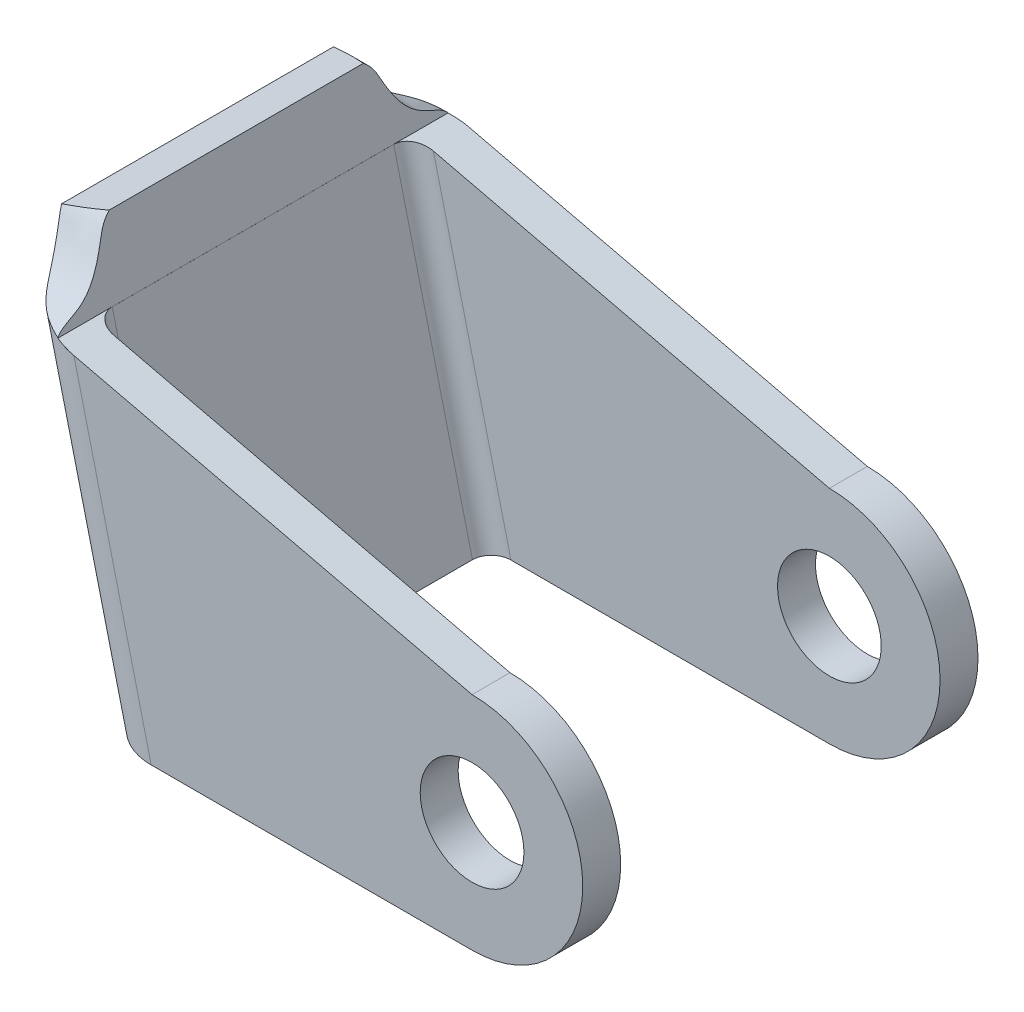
ISO-10303-21;
HEADER;
FILE_DESCRIPTION(('STEP AP214'),'2;1');
FILE_NAME('part.step','',(''),(''),'','','');
FILE_SCHEMA(('AUTOMOTIVE_DESIGN { 1 0 10303 214 1 1 1 1 }'));
ENDSEC;
DATA;
#1=APPLICATION_CONTEXT('core data for automotive mechanical design processes');
#2=APPLICATION_PROTOCOL_DEFINITION('international standard','automotive_design',2000,#1);
#3=PRODUCT_CONTEXT('',#1,'mechanical');
#4=PRODUCT('Part','Part','',(#3));
#5=PRODUCT_RELATED_PRODUCT_CATEGORY('part','',(#4));
#6=PRODUCT_DEFINITION_FORMATION('','',#4);
#7=PRODUCT_DEFINITION_CONTEXT('part definition',#1,'design');
#8=PRODUCT_DEFINITION('design','',#6,#7);
#9=PRODUCT_DEFINITION_SHAPE('','',#8);
#10=(LENGTH_UNIT() NAMED_UNIT(*) SI_UNIT(.MILLI.,.METRE.));
#11=(NAMED_UNIT(*) PLANE_ANGLE_UNIT() SI_UNIT($,.RADIAN.));
#12=(NAMED_UNIT(*) SI_UNIT($,.STERADIAN.) SOLID_ANGLE_UNIT());
#13=UNCERTAINTY_MEASURE_WITH_UNIT(LENGTH_MEASURE(1.E-05),#10,'distance_accuracy_value','');
#14=(GEOMETRIC_REPRESENTATION_CONTEXT(3) GLOBAL_UNCERTAINTY_ASSIGNED_CONTEXT((#13)) GLOBAL_UNIT_ASSIGNED_CONTEXT((#10,
#11,#12)) REPRESENTATION_CONTEXT('',''));
#15=CARTESIAN_POINT('',(0.,0.,0.));
#16=DIRECTION('',(0.,0.,1.));
#17=DIRECTION('',(1.,0.,0.));
#18=AXIS2_PLACEMENT_3D('',#15,#16,#17);
#19=CARTESIAN_POINT('',(0.,0.,7.9375));
#20=DIRECTION('',(0.,0.,-1.));
#21=DIRECTION('',(-1.,0.,0.));
#22=AXIS2_PLACEMENT_3D('',#19,#20,#21);
#23=CYLINDRICAL_SURFACE('',#22,4.445);
#24=CARTESIAN_POINT('',(0.,0.,6.4135));
#25=DIRECTION('',(0.,0.,-1.));
#26=DIRECTION('',(-1.,0.,0.));
#27=AXIS2_PLACEMENT_3D('',#24,#25,#26);
#28=CIRCLE('',#27,4.445);
#29=CARTESIAN_POINT('',(0.,4.445,6.4135));
#30=VERTEX_POINT('',#29);
#31=CARTESIAN_POINT('',(0.,-4.445,6.4135));
#32=VERTEX_POINT('',#31);
#33=EDGE_CURVE('E369',#30,#32,#28,.T.);
#34=ORIENTED_EDGE('',*,*,#33,.F.);
#35=DIRECTION('',(0.,0.,-1.));
#36=VECTOR('',#35,1.);
#37=CARTESIAN_POINT('',(0.,4.445,7.9375));
#38=LINE('',#37,#36);
#39=CARTESIAN_POINT('',(0.,4.445,7.9375));
#40=VERTEX_POINT('',#39);
#41=EDGE_CURVE('E193',#40,#30,#38,.T.);
#42=ORIENTED_EDGE('',*,*,#41,.F.);
#43=CARTESIAN_POINT('',(0.,0.,7.9375));
#44=DIRECTION('',(0.,0.,1.));
#45=DIRECTION('',(1.,0.,0.));
#46=AXIS2_PLACEMENT_3D('',#43,#44,#45);
#47=CIRCLE('',#46,4.445);
#48=CARTESIAN_POINT('',(0.,-4.445,7.9375));
#49=VERTEX_POINT('',#48);
#50=EDGE_CURVE('E363',#49,#40,#47,.T.);
#51=ORIENTED_EDGE('',*,*,#50,.F.);
#52=DIRECTION('',(0.,0.,-1.));
#53=VECTOR('',#52,1.);
#54=CARTESIAN_POINT('',(0.,-4.445,7.9375));
#55=LINE('',#54,#53);
#56=EDGE_CURVE('E186',#49,#32,#55,.T.);
#57=ORIENTED_EDGE('',*,*,#56,.T.);
#58=EDGE_LOOP('',(#34,#42,#51,#57));
#59=FACE_BOUND('',#58,.T.);
#60=ADVANCED_FACE('F30',(#59),#23,.T.);
#61=CARTESIAN_POINT('',(0.,4.445,7.9375));
#62=DIRECTION('',(-0.231189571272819,-0.972908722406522,0.));
#63=DIRECTION('',(0.972908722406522,-0.231189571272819,0.));
#64=AXIS2_PLACEMENT_3D('',#61,#62,#63);
#65=PLANE('',#64);
#66=CARTESIAN_POINT('',(-15.9881489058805,8.24421898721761,-5.6515));
#67=DIRECTION('',(-0.231189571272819,-0.972908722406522,0.));
#68=DIRECTION('',(0.972908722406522,-0.231189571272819,0.));
#69=AXIS2_PLACEMENT_3D('',#66,#67,#68);
#70=ELLIPSE('',#69,2.5679668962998,2.286);
#71=CARTESIAN_POINT('',(-15.9881489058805,8.24421898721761,-7.9375));
#72=VERTEX_POINT('',#71);
#73=CARTESIAN_POINT('',(-16.2225683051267,8.29992341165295,-7.92741515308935));
#74=VERTEX_POINT('',#73);
#75=EDGE_CURVE('E244',#72,#74,#70,.F.);
#76=ORIENTED_EDGE('',*,*,#75,.T.);
#77=CARTESIAN_POINT('',(-16.1339768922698,8.2788716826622,-7.9375));
#78=CARTESIAN_POINT('',(-16.1677330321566,8.28689305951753,-7.93385605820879));
#79=CARTESIAN_POINT('',(-16.2014674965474,8.29490928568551,-7.92999399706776));
#80=CARTESIAN_POINT('',(-16.2688651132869,8.31092479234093,-7.9217951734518));
#81=CARTESIAN_POINT('',(-16.3025282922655,8.31892407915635,-7.91745864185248));
#82=CARTESIAN_POINT('',(-16.3697787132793,8.33490460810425,-7.9082702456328));
#83=CARTESIAN_POINT('',(-16.4033659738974,8.34288585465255,-7.90341852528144));
#84=CARTESIAN_POINT('',(-16.4704626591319,8.35882985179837,-7.89316456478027));
#85=CARTESIAN_POINT('',(-16.5039720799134,8.36679260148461,-7.88776229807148));
#86=CARTESIAN_POINT('',(-16.5709041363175,8.38269747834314,-7.87636773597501));
#87=CARTESIAN_POINT('',(-16.6043267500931,8.39063960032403,-7.87037530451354));
#88=CARTESIAN_POINT('',(-16.6710774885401,8.4065013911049,-7.85775785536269));
#89=CARTESIAN_POINT('',(-16.7044055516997,8.41442104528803,-7.85113249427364));
#90=CARTESIAN_POINT('',(-16.7376681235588,8.42232513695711,-7.84417210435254));
#91=B_SPLINE_CURVE_WITH_KNOTS('',3,(#77,#78,#79,#80,#81,#82,#83,#84,#85,#86,#87,#88,#89,#90),
.UNSPECIFIED.,.F.,.F.,(4,2,2,2,2,2,4),(0.,0.104661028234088,0.209271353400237,0.313852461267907,
0.418438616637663,0.523048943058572,0.627716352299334),.UNSPECIFIED.);
#92=CARTESIAN_POINT('',(-16.5229555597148,8.37130359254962,-7.88451175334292));
#93=VERTEX_POINT('',#92);
#94=EDGE_CURVE('E332',#74,#93,#91,.T.);
#95=ORIENTED_EDGE('',*,*,#94,.T.);
#96=CARTESIAN_POINT('',(-16.7376681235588,8.42232513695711,-7.83220501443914));
#97=VERTEX_POINT('',#96);
#98=EDGE_CURVE('E243',#93,#97,#70,.F.);
#99=ORIENTED_EDGE('',*,*,#98,.T.);
#100=DIRECTION('',(0.,0.,-1.));
#101=VECTOR('',#100,1.);
#102=CARTESIAN_POINT('',(-16.7376681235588,8.42232513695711,7.9375));
#103=LINE('',#102,#101);
#104=CARTESIAN_POINT('',(-16.7376681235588,8.42232513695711,7.83220501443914));
#105=VERTEX_POINT('',#104);
#106=EDGE_CURVE('E183',#105,#97,#103,.T.);
#107=ORIENTED_EDGE('',*,*,#106,.F.);
#108=CARTESIAN_POINT('',(-15.9881489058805,8.24421898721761,5.6515));
#109=DIRECTION('',(-0.231189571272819,-0.972908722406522,0.));
#110=DIRECTION('',(-0.972908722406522,0.231189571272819,0.));
#111=AXIS2_PLACEMENT_3D('',#108,#109,#110);
#112=ELLIPSE('',#111,2.5679668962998,2.286);
#113=CARTESIAN_POINT('',(-16.5229555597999,8.37130359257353,7.88451175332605));
#114=VERTEX_POINT('',#113);
#115=EDGE_CURVE('E248',#105,#114,#112,.F.);
#116=ORIENTED_EDGE('',*,*,#115,.T.);
#117=CARTESIAN_POINT('',(-16.7376681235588,8.42232513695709,7.84417210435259));
#118=CARTESIAN_POINT('',(-16.7044055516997,8.41442104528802,7.85113249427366));
#119=CARTESIAN_POINT('',(-16.6710774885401,8.4065013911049,7.85775785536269));
#120=CARTESIAN_POINT('',(-16.6043267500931,8.39063960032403,7.87037530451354));
#121=CARTESIAN_POINT('',(-16.5709041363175,8.38269747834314,7.87636773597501));
#122=CARTESIAN_POINT('',(-16.5039720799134,8.36679260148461,7.88776229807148));
#123=CARTESIAN_POINT('',(-16.4704626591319,8.35882985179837,7.89316456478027));
#124=CARTESIAN_POINT('',(-16.4033659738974,8.34288585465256,7.90341852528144));
#125=CARTESIAN_POINT('',(-16.3697787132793,8.33490460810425,7.9082702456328));
#126=CARTESIAN_POINT('',(-16.3025282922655,8.31892407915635,7.91745864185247));
#127=CARTESIAN_POINT('',(-16.2688651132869,8.31092479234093,7.9217951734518));
#128=CARTESIAN_POINT('',(-16.2014674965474,8.29490928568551,7.92999399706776));
#129=CARTESIAN_POINT('',(-16.1677330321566,8.28689305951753,7.93385605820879));
#130=CARTESIAN_POINT('',(-16.1339768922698,8.2788716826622,7.9375));
#131=B_SPLINE_CURVE_WITH_KNOTS('',3,(#117,#118,#119,#120,#121,#122,#123,#124,#125,#126,#127,
#128,#129,#130),.UNSPECIFIED.,.F.,.F.,(4,2,2,2,2,2,4),(0.,0.104667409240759,0.209277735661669,
0.313863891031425,0.418444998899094,0.52305532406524,0.627716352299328),.UNSPECIFIED.);
#132=CARTESIAN_POINT('',(-16.2225683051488,8.2999234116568,7.92741515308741));
#133=VERTEX_POINT('',#132);
#134=EDGE_CURVE('E49',#114,#133,#131,.T.);
#135=ORIENTED_EDGE('',*,*,#134,.T.);
#136=CARTESIAN_POINT('',(-15.9881489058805,8.24421898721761,7.9375));
#137=VERTEX_POINT('',#136);
#138=EDGE_CURVE('E247',#133,#137,#112,.F.);
#139=ORIENTED_EDGE('',*,*,#138,.T.);
#140=DIRECTION('',(-0.972908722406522,0.231189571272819,0.));
#141=VECTOR('',#140,1.);
#142=CARTESIAN_POINT('',(0.,4.445,7.9375));
#143=LINE('',#142,#141);
#144=EDGE_CURVE('E354',#40,#137,#143,.T.);
#145=ORIENTED_EDGE('',*,*,#144,.F.);
#146=ORIENTED_EDGE('',*,*,#41,.T.);
#147=DIRECTION('',(0.972908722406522,-0.231189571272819,0.));
#148=VECTOR('',#147,1.);
#149=CARTESIAN_POINT('',(0.,4.445,6.4135));
#150=LINE('',#149,#148);
#151=CARTESIAN_POINT('',(-15.9033399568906,8.22406607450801,6.4135));
#152=VERTEX_POINT('',#151);
#153=EDGE_CURVE('E388',#152,#30,#150,.T.);
#154=ORIENTED_EDGE('',*,*,#153,.F.);
#155=CARTESIAN_POINT('',(-15.9033399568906,8.22406607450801,5.6515));
#156=DIRECTION('',(-0.231189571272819,-0.972908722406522,0.));
#157=DIRECTION('',(-0.972908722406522,0.231189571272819,0.));
#158=AXIS2_PLACEMENT_3D('',#155,#156,#157);
#159=ELLIPSE('',#158,0.856606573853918,0.762);
#160=CARTESIAN_POINT('',(-16.7367399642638,8.42210458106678,5.6515));
#161=VERTEX_POINT('',#160);
#162=EDGE_CURVE('E225',#152,#161,#159,.T.);
#163=ORIENTED_EDGE('',*,*,#162,.T.);
#164=DIRECTION('',(0.,0.,1.));
#165=VECTOR('',#164,1.);
#166=CARTESIAN_POINT('',(-16.7367399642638,8.42210458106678,7.9375));
#167=LINE('',#166,#165);
#168=CARTESIAN_POINT('',(-16.7367399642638,8.42210458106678,-5.6515));
#169=VERTEX_POINT('',#168);
#170=EDGE_CURVE('E385',#169,#161,#167,.T.);
#171=ORIENTED_EDGE('',*,*,#170,.F.);
#172=CARTESIAN_POINT('',(-15.9033399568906,8.22406607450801,-5.6515));
#173=DIRECTION('',(-0.231189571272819,-0.972908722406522,0.));
#174=DIRECTION('',(0.972908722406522,-0.231189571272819,0.));
#175=AXIS2_PLACEMENT_3D('',#172,#173,#174);
#176=ELLIPSE('',#175,0.856606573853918,0.762);
#177=CARTESIAN_POINT('',(-15.9033399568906,8.22406607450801,-6.4135));
#178=VERTEX_POINT('',#177);
#179=EDGE_CURVE('E221',#169,#178,#176,.T.);
#180=ORIENTED_EDGE('',*,*,#179,.T.);
#181=DIRECTION('',(0.972908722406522,-0.231189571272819,0.));
#182=VECTOR('',#181,1.);
#183=CARTESIAN_POINT('',(0.,4.445,-6.4135));
#184=LINE('',#183,#182);
#185=CARTESIAN_POINT('',(0.,4.445,-6.4135));
#186=VERTEX_POINT('',#185);
#187=EDGE_CURVE('E206',#178,#186,#184,.T.);
#188=ORIENTED_EDGE('',*,*,#187,.T.);
#189=CARTESIAN_POINT('',(0.,4.445,-7.9375));
#190=VERTEX_POINT('',#189);
#191=EDGE_CURVE('E192',#186,#190,#38,.T.);
#192=ORIENTED_EDGE('',*,*,#191,.T.);
#193=DIRECTION('',(-0.972908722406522,0.231189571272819,0.));
#194=VECTOR('',#193,1.);
#195=CARTESIAN_POINT('',(0.,4.445,-7.9375));
#196=LINE('',#195,#194);
#197=EDGE_CURVE('E376',#190,#72,#196,.T.);
#198=ORIENTED_EDGE('',*,*,#197,.T.);
#199=EDGE_LOOP('',(#76,#95,#99,#107,#116,#135,#139,#145,#146,#154,#163,#171,#180,#188,#192,#198));
#200=FACE_BOUND('',#199,.T.);
#201=ADVANCED_FACE('F326',(#200),#65,.F.);
#202=CARTESIAN_POINT('',(0.,-4.445,7.9375));
#203=DIRECTION('',(0.,1.,0.));
#204=DIRECTION('',(-1.,0.,0.));
#205=AXIS2_PLACEMENT_3D('',#202,#203,#204);
#206=PLANE('',#205);
#207=DIRECTION('',(1.,0.,0.));
#208=VECTOR('',#207,1.);
#209=CARTESIAN_POINT('',(0.,-4.445,7.9375));
#210=LINE('',#209,#208);
#211=CARTESIAN_POINT('',(-12.8867088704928,-4.445,7.9375));
#212=VERTEX_POINT('',#211);
#213=EDGE_CURVE('E352',#212,#49,#210,.T.);
#214=ORIENTED_EDGE('',*,*,#213,.F.);
#215=CARTESIAN_POINT('',(-12.8867088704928,-4.445,5.6515));
#216=DIRECTION('',(0.,1.,0.));
#217=DIRECTION('',(-1.,0.,0.));
#218=AXIS2_PLACEMENT_3D('',#215,#216,#217);
#219=ELLIPSE('',#218,2.35329112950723,2.286);
#220=CARTESIAN_POINT('',(-15.24,-4.445,5.6515));
#221=VERTEX_POINT('',#220);
#222=EDGE_CURVE('E232',#212,#221,#219,.F.);
#223=ORIENTED_EDGE('',*,*,#222,.T.);
#224=DIRECTION('',(0.,0.,-1.));
#225=VECTOR('',#224,1.);
#226=CARTESIAN_POINT('',(-15.24,-4.445,7.9375));
#227=LINE('',#226,#225);
#228=CARTESIAN_POINT('',(-15.24,-4.445,-5.6515));
#229=VERTEX_POINT('',#228);
#230=EDGE_CURVE('E181',#221,#229,#227,.T.);
#231=ORIENTED_EDGE('',*,*,#230,.T.);
#232=CARTESIAN_POINT('',(-12.8867088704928,-4.445,-5.6515));
#233=DIRECTION('',(0.,1.,0.));
#234=DIRECTION('',(1.,0.,0.));
#235=AXIS2_PLACEMENT_3D('',#232,#233,#234);
#236=ELLIPSE('',#235,2.35329112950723,2.286);
#237=CARTESIAN_POINT('',(-12.8867088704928,-4.445,-7.9375));
#238=VERTEX_POINT('',#237);
#239=EDGE_CURVE('E230',#229,#238,#236,.F.);
#240=ORIENTED_EDGE('',*,*,#239,.T.);
#241=DIRECTION('',(1.,0.,0.));
#242=VECTOR('',#241,1.);
#243=CARTESIAN_POINT('',(0.,-4.445,-7.9375));
#244=LINE('',#243,#242);
#245=CARTESIAN_POINT('',(0.,-4.445,-7.9375));
#246=VERTEX_POINT('',#245);
#247=EDGE_CURVE('E372',#238,#246,#244,.T.);
#248=ORIENTED_EDGE('',*,*,#247,.T.);
#249=CARTESIAN_POINT('',(0.,-4.445,-6.4135));
#250=VERTEX_POINT('',#249);
#251=EDGE_CURVE('E360',#250,#246,#55,.T.);
#252=ORIENTED_EDGE('',*,*,#251,.F.);
#253=DIRECTION('',(-1.,0.,0.));
#254=VECTOR('',#253,1.);
#255=CARTESIAN_POINT('',(0.,-4.445,-6.4135));
#256=LINE('',#255,#254);
#257=CARTESIAN_POINT('',(-12.7879301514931,-4.445,-6.4135));
#258=VERTEX_POINT('',#257);
#259=EDGE_CURVE('E200',#250,#258,#256,.T.);
#260=ORIENTED_EDGE('',*,*,#259,.T.);
#261=CARTESIAN_POINT('',(-12.7879301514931,-4.445,-5.6515));
#262=DIRECTION('',(0.,1.,0.));
#263=DIRECTION('',(1.,0.,0.));
#264=AXIS2_PLACEMENT_3D('',#261,#262,#263);
#265=ELLIPSE('',#264,0.78470098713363,0.762);
#266=CARTESIAN_POINT('',(-13.5726311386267,-4.445,-5.6515));
#267=VERTEX_POINT('',#266);
#268=EDGE_CURVE('E219',#258,#267,#265,.T.);
#269=ORIENTED_EDGE('',*,*,#268,.T.);
#270=DIRECTION('',(0.,0.,-1.));
#271=VECTOR('',#270,1.);
#272=CARTESIAN_POINT('',(-13.5726311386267,-4.445,7.9375));
#273=LINE('',#272,#271);
#274=CARTESIAN_POINT('',(-13.5726311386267,-4.445,5.6515));
#275=VERTEX_POINT('',#274);
#276=EDGE_CURVE('E196',#275,#267,#273,.T.);
#277=ORIENTED_EDGE('',*,*,#276,.F.);
#278=CARTESIAN_POINT('',(-12.7879301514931,-4.445,5.6515));
#279=DIRECTION('',(0.,1.,0.));
#280=DIRECTION('',(-1.,0.,0.));
#281=AXIS2_PLACEMENT_3D('',#278,#279,#280);
#282=ELLIPSE('',#281,0.78470098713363,0.762);
#283=CARTESIAN_POINT('',(-12.7879301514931,-4.445,6.4135));
#284=VERTEX_POINT('',#283);
#285=EDGE_CURVE('E223',#275,#284,#282,.T.);
#286=ORIENTED_EDGE('',*,*,#285,.T.);
#287=DIRECTION('',(-1.,0.,0.));
#288=VECTOR('',#287,1.);
#289=CARTESIAN_POINT('',(0.,-4.445,6.4135));
#290=LINE('',#289,#288);
#291=EDGE_CURVE('E205',#32,#284,#290,.T.);
#292=ORIENTED_EDGE('',*,*,#291,.F.);
#293=ORIENTED_EDGE('',*,*,#56,.F.);
#294=EDGE_LOOP('',(#214,#223,#231,#240,#248,#252,#260,#269,#277,#286,#292,#293));
#295=FACE_BOUND('',#294,.T.);
#296=ADVANCED_FACE('F296',(#295),#206,.F.);
#297=CARTESIAN_POINT('',(0.,0.,7.9375));
#298=DIRECTION('',(0.,0.,-1.));
#299=DIRECTION('',(-1.,0.,0.));
#300=AXIS2_PLACEMENT_3D('',#297,#298,#299);
#301=CYLINDRICAL_SURFACE('',#300,2.0828);
#302=CARTESIAN_POINT('',(0.,0.,7.9375));
#303=DIRECTION('',(0.,0.,1.));
#304=DIRECTION('',(1.,0.,0.));
#305=AXIS2_PLACEMENT_3D('',#302,#303,#304);
#306=CIRCLE('',#305,2.0828);
#307=CARTESIAN_POINT('',(2.0828,0.,7.9375));
#308=VERTEX_POINT('',#307);
#309=EDGE_CURVE('E370',#308,#308,#306,.T.);
#310=ORIENTED_EDGE('',*,*,#309,.T.);
#311=EDGE_LOOP('',(#310));
#312=FACE_BOUND('',#311,.T.);
#313=CARTESIAN_POINT('',(0.,0.,6.4135));
#314=DIRECTION('',(0.,0.,-1.));
#315=DIRECTION('',(-1.,0.,0.));
#316=AXIS2_PLACEMENT_3D('',#313,#314,#315);
#317=CIRCLE('',#316,2.0828);
#318=CARTESIAN_POINT('',(-2.0828,0.,6.4135));
#319=VERTEX_POINT('',#318);
#320=EDGE_CURVE('E202',#319,#319,#317,.T.);
#321=ORIENTED_EDGE('',*,*,#320,.T.);
#322=EDGE_LOOP('',(#321));
#323=FACE_BOUND('',#322,.T.);
#324=ADVANCED_FACE('F440',(#312,#323),#301,.F.);
#325=CARTESIAN_POINT('',(0.,0.,7.9375));
#326=DIRECTION('',(0.,0.,1.));
#327=DIRECTION('',(1.,0.,0.));
#328=AXIS2_PLACEMENT_3D('',#325,#326,#327);
#329=PLANE('',#328);
#330=ORIENTED_EDGE('',*,*,#144,.T.);
#331=DIRECTION('',(0.237426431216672,-0.971405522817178,0.));
#332=VECTOR('',#331,1.);
#333=CARTESIAN_POINT('',(-13.0193669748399,-3.90224317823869,7.9375));
#334=LINE('',#333,#332);
#335=EDGE_CURVE('E227',#137,#212,#334,.T.);
#336=ORIENTED_EDGE('',*,*,#335,.T.);
#337=ORIENTED_EDGE('',*,*,#213,.T.);
#338=ORIENTED_EDGE('',*,*,#50,.T.);
#339=EDGE_LOOP('',(#330,#336,#337,#338));
#340=FACE_BOUND('',#339,.T.);
#341=ORIENTED_EDGE('',*,*,#309,.F.);
#342=EDGE_LOOP('',(#341));
#343=FACE_BOUND('',#342,.T.);
#344=ADVANCED_FACE('F349',(#340,#343),#329,.T.);
#345=ORIENTED_EDGE('',*,*,#191,.F.);
#346=CARTESIAN_POINT('',(0.,0.,-6.4135));
#347=DIRECTION('',(0.,0.,-1.));
#348=DIRECTION('',(-1.,0.,0.));
#349=AXIS2_PLACEMENT_3D('',#346,#347,#348);
#350=CIRCLE('',#349,4.445);
#351=EDGE_CURVE('E393',#186,#250,#350,.T.);
#352=ORIENTED_EDGE('',*,*,#351,.T.);
#353=ORIENTED_EDGE('',*,*,#251,.T.);
#354=CARTESIAN_POINT('',(0.,0.,-7.9375));
#355=DIRECTION('',(0.,0.,1.));
#356=DIRECTION('',(1.,0.,0.));
#357=AXIS2_PLACEMENT_3D('',#354,#355,#356);
#358=CIRCLE('',#357,4.445);
#359=EDGE_CURVE('E379',#246,#190,#358,.T.);
#360=ORIENTED_EDGE('',*,*,#359,.T.);
#361=EDGE_LOOP('',(#345,#352,#353,#360));
#362=FACE_BOUND('',#361,.T.);
#363=ADVANCED_FACE('F32',(#362),#23,.T.);
#364=CARTESIAN_POINT('',(-16.7376681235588,8.42232513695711,7.9375));
#365=DIRECTION('',(-0.971405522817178,-0.237426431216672,0.));
#366=DIRECTION('',(0.237426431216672,-0.971405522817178,0.));
#367=AXIS2_PLACEMENT_3D('',#364,#365,#366);
#368=PLANE('',#367);
#369=DIRECTION('',(0.237426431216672,-0.971405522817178,0.));
#370=VECTOR('',#369,1.);
#371=CARTESIAN_POINT('',(-16.7376681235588,8.42232513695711,-7.83220501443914));
#372=LINE('',#371,#370);
#373=CARTESIAN_POINT('',(-16.7408977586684,8.43553885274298,-7.83220501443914));
#374=VERTEX_POINT('',#373);
#375=EDGE_CURVE('E238',#97,#374,#372,.F.);
#376=ORIENTED_EDGE('',*,*,#375,.T.);
#377=CARTESIAN_POINT('',(-16.7408977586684,8.43553885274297,-7.83220501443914));
#378=CARTESIAN_POINT('',(-16.7450739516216,8.45262531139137,-7.81630435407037));
#379=CARTESIAN_POINT('',(-16.7490404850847,8.46885397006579,-7.79948220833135));
#380=CARTESIAN_POINT('',(-16.7565587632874,8.49961422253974,-7.76450328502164));
#381=CARTESIAN_POINT('',(-16.7601135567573,8.51415828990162,-7.74635818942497));
#382=CARTESIAN_POINT('',(-16.766872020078,8.54180983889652,-7.70901118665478));
#383=CARTESIAN_POINT('',(-16.7700763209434,8.55491990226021,-7.68981127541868));
#384=CARTESIAN_POINT('',(-16.7761953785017,8.57995538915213,-7.65057133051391));
#385=CARTESIAN_POINT('',(-16.7791096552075,8.59187884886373,-7.63052997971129));
#386=CARTESIAN_POINT('',(-16.7846980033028,8.61474299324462,-7.5898174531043));
#387=CARTESIAN_POINT('',(-16.7873716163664,8.62568180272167,-7.56914517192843));
#388=CARTESIAN_POINT('',(-16.7925227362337,8.64675707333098,-7.52735691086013));
#389=CARTESIAN_POINT('',(-16.795000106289,8.65689297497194,-7.50624063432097));
#390=CARTESIAN_POINT('',(-16.8022498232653,8.68655443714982,-7.44203512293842));
#391=CARTESIAN_POINT('',(-16.8067883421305,8.70512331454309,-7.39848180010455));
#392=CARTESIAN_POINT('',(-16.8155689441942,8.74104823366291,-7.31089730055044));
#393=CARTESIAN_POINT('',(-16.8198111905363,8.75840494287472,-7.26686640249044));
#394=CARTESIAN_POINT('',(-16.8282841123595,8.79307102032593,-7.1787900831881));
#395=CARTESIAN_POINT('',(-16.8325147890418,8.81038039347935,-7.13474466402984));
#396=CARTESIAN_POINT('',(-16.8412359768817,8.84606222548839,-7.04708612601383));
#397=CARTESIAN_POINT('',(-16.8457265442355,8.86443491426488,-7.00347310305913));
#398=CARTESIAN_POINT('',(-16.8528288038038,8.89349306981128,-6.93914960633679));
#399=CARTESIAN_POINT('',(-16.8552378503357,8.90334943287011,-6.91804571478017));
#400=CARTESIAN_POINT('',(-16.8602253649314,8.92375532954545,-6.87619714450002));
#401=CARTESIAN_POINT('',(-16.8628038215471,8.93430481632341,-6.85545244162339));
#402=CARTESIAN_POINT('',(-16.870819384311,8.96709965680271,-6.79385291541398));
#403=CARTESIAN_POINT('',(-16.8765363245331,8.9904899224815,-6.75363601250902));
#404=CARTESIAN_POINT('',(-16.8886586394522,9.0400871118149,-6.67510597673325));
#405=CARTESIAN_POINT('',(-16.8950638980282,9.06629356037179,-6.63679252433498));
#406=CARTESIAN_POINT('',(-16.9085032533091,9.1212792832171,-6.56222217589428));
#407=CARTESIAN_POINT('',(-16.9155369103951,9.15005675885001,-6.52596387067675));
#408=CARTESIAN_POINT('',(-16.9327585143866,9.2205171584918,-6.44307272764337));
#409=CARTESIAN_POINT('',(-16.9431821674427,9.26316444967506,-6.39730671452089));
#410=CARTESIAN_POINT('',(-16.9649020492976,9.35202908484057,-6.30950821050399));
#411=CARTESIAN_POINT('',(-16.9761994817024,9.39825135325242,-6.26748104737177));
#412=CARTESIAN_POINT('',(-16.999499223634,9.49357982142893,-6.18695599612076));
#413=CARTESIAN_POINT('',(-17.0115023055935,9.54268918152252,-6.14846209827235));
#414=CARTESIAN_POINT('',(-17.0364425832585,9.64472973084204,-6.07354841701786));
#415=CARTESIAN_POINT('',(-17.049397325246,9.6977327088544,-6.03723297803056));
#416=CARTESIAN_POINT('',(-17.075736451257,9.80549650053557,-5.96765206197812));
#417=CARTESIAN_POINT('',(-17.0891203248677,9.86025522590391,-5.93438313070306));
#418=CARTESIAN_POINT('',(-17.1161989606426,9.97104464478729,-5.87043632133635));
#419=CARTESIAN_POINT('',(-17.12989312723,10.0270729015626,-5.8397539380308));
#420=CARTESIAN_POINT('',(-17.1559943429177,10.1338633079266,-5.78374655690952));
#421=CARTESIAN_POINT('',(-17.168375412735,10.1845191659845,-5.75820502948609));
#422=CARTESIAN_POINT('',(-17.1932958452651,10.2864785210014,-5.70837846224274));
#423=CARTESIAN_POINT('',(-17.2058353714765,10.3377826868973,-5.68409487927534));
#424=CARTESIAN_POINT('',(-17.2247527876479,10.4151813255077,-5.6483964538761));
#425=CARTESIAN_POINT('',(-17.2310897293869,10.4411082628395,-5.63659467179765));
#426=CARTESIAN_POINT('',(-17.243763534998,10.4929618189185,-5.61299479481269));
#427=CARTESIAN_POINT('',(-17.2501003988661,10.5188884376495,-5.60119669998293));
#428=CARTESIAN_POINT('',(-17.2687138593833,10.5950434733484,-5.56593740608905));
#429=CARTESIAN_POINT('',(-17.280942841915,10.6450770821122,-5.54199353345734));
#430=CARTESIAN_POINT('',(-17.2989165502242,10.7186146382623,-5.50327071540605));
#431=CARTESIAN_POINT('',(-17.3048333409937,10.7428225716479,-5.48992821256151));
#432=CARTESIAN_POINT('',(-17.3164996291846,10.7905539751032,-5.46200132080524));
#433=CARTESIAN_POINT('',(-17.3222491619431,10.8140775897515,-5.44741719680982));
#434=CARTESIAN_POINT('',(-17.333486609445,10.8600544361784,-5.41675577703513));
#435=CARTESIAN_POINT('',(-17.3389755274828,10.8825117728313,-5.40068505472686));
#436=CARTESIAN_POINT('',(-17.3496779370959,10.9262995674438,-5.36699585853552));
#437=CARTESIAN_POINT('',(-17.3548914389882,10.9476300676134,-5.34937744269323));
#438=CARTESIAN_POINT('',(-17.364563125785,10.9872007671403,-5.31454260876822));
#439=CARTESIAN_POINT('',(-17.3690460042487,11.0055419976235,-5.29744712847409));
#440=CARTESIAN_POINT('',(-17.377798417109,11.0413515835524,-5.26223251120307));
#441=CARTESIAN_POINT('',(-17.3820674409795,11.0588178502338,-5.24411112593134));
#442=CARTESIAN_POINT('',(-17.3904977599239,11.0933096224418,-5.20649231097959));
#443=CARTESIAN_POINT('',(-17.3946530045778,11.1103103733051,-5.1869709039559));
#444=CARTESIAN_POINT('',(-17.402723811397,11.1433312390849,-5.14717813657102));
#445=CARTESIAN_POINT('',(-17.4066401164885,11.1593543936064,-5.12690945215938));
#446=CARTESIAN_POINT('',(-17.4104469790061,11.174929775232,-5.10628811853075));
#447=B_SPLINE_CURVE_WITH_KNOTS('',3,(#377,#378,#379,#380,#381,#382,#383,#384,#385,#386,#387,
#388,#389,#390,#391,#392,#393,#394,#395,#396,#397,#398,#399,#400,#401,#402,#403,#404,#405,#406,
#407,#408,#409,#410,#411,#412,#413,#414,#415,#416,#417,#418,#419,#420,#421,#422,#423,#424,#425,
#426,#427,#428,#429,#430,#431,#432,#433,#434,#435,#436,#437,#438,#439,#440,#441,#442,#443,#444,
#445,#446),.UNSPECIFIED.,.F.,.F.,(4,2,2,2,2,2,2,2,2,2,2,2,2,2,2,2,2,2,2,2,2,2,2,2,2,2,2,2,2,2,2,
2,2,2,4),(0.,0.0710458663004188,0.141526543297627,0.211878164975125,0.282344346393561,
0.352942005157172,0.42358843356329,0.566223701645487,0.708779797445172,0.851320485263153,
0.993892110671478,1.06412986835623,1.13436288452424,1.27483988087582,1.41529321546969,
1.55564904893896,1.74565102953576,1.93591956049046,2.12640039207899,2.32291578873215,
2.51920553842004,2.71514600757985,2.88932328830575,3.06369797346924,3.15124535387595,
3.23879444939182,3.40910185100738,3.49387734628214,3.57863479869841,3.66303391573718,
3.7474298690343,3.82380472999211,3.90035398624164,3.97897676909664,4.05734112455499),.UNSPECIFIED.);
#448=CARTESIAN_POINT('',(-17.4104469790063,11.1749297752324,-5.10628811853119));
#449=VERTEX_POINT('',#448);
#450=EDGE_CURVE('E177',#374,#449,#447,.T.);
#451=ORIENTED_EDGE('',*,*,#450,.T.);
#452=DIRECTION('',(0.,0.,-1.));
#453=VECTOR('',#452,1.);
#454=CARTESIAN_POINT('',(-17.4104469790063,11.1749297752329,7.9375));
#455=LINE('',#454,#453);
#456=CARTESIAN_POINT('',(-17.4104469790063,11.1749297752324,5.1062881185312));
#457=VERTEX_POINT('',#456);
#458=EDGE_CURVE('E176',#457,#449,#455,.T.);
#459=ORIENTED_EDGE('',*,*,#458,.F.);
#460=CARTESIAN_POINT('',(-17.4104469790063,11.1749297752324,5.10628811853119));
#461=CARTESIAN_POINT('',(-17.4062551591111,11.157779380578,5.12899427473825));
#462=CARTESIAN_POINT('',(-17.4019305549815,11.1400857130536,5.15127396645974));
#463=CARTESIAN_POINT('',(-17.3930137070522,11.1036033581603,5.19480984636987));
#464=CARTESIAN_POINT('',(-17.3884218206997,11.0848161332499,5.2160673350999));
#465=CARTESIAN_POINT('',(-17.3789630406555,11.046116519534,5.25742376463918));
#466=CARTESIAN_POINT('',(-17.3740964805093,11.0262054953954,5.27752405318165));
#467=CARTESIAN_POINT('',(-17.3640750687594,10.9852039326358,5.31644263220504));
#468=CARTESIAN_POINT('',(-17.3589200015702,10.9641125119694,5.33525994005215));
#469=CARTESIAN_POINT('',(-17.3483294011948,10.920782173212,5.37141348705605));
#470=CARTESIAN_POINT('',(-17.3428940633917,10.8985440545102,5.38875073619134));
#471=CARTESIAN_POINT('',(-17.3317450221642,10.8529289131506,5.4217410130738));
#472=CARTESIAN_POINT('',(-17.3260313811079,10.8295521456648,5.43739441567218));
#473=CARTESIAN_POINT('',(-17.3114838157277,10.7700322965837,5.47471160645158));
#474=CARTESIAN_POINT('',(-17.3025192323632,10.7333546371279,5.49546325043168));
#475=CARTESIAN_POINT('',(-17.2843187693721,10.658889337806,5.53476404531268));
#476=CARTESIAN_POINT('',(-17.2750826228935,10.6211006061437,5.55331093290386));
#477=CARTESIAN_POINT('',(-17.2564551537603,10.5448882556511,5.58936035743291));
#478=CARTESIAN_POINT('',(-17.2470633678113,10.5064627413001,5.60685855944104));
#479=CARTESIAN_POINT('',(-17.2329758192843,10.4488250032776,5.63307868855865));
#480=CARTESIAN_POINT('',(-17.2282811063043,10.4296170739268,5.6418121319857));
#481=CARTESIAN_POINT('',(-17.2189050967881,10.3912561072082,5.65940559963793));
#482=CARTESIAN_POINT('',(-17.2142238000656,10.3721030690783,5.66826562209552));
#483=CARTESIAN_POINT('',(-17.2001747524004,10.3146228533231,5.69511963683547));
#484=CARTESIAN_POINT('',(-17.1908306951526,10.276392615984,5.71333459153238));
#485=CARTESIAN_POINT('',(-17.1722219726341,10.2002569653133,5.75048914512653));
#486=CARTESIAN_POINT('',(-17.1629573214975,10.1623516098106,5.76942886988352));
#487=CARTESIAN_POINT('',(-17.1445002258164,10.0868363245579,5.80822774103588));
#488=CARTESIAN_POINT('',(-17.1353081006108,10.0492277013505,5.82808959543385));
#489=CARTESIAN_POINT('',(-17.1170504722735,9.97452851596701,5.86881235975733));
#490=CARTESIAN_POINT('',(-17.1079849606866,9.93743791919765,5.88967320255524));
#491=CARTESIAN_POINT('',(-17.0816834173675,9.82982789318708,5.95237513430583));
#492=CARTESIAN_POINT('',(-17.0646514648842,9.76014343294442,5.99576338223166));
#493=CARTESIAN_POINT('',(-17.0313493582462,9.62389133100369,6.08785342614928));
#494=CARTESIAN_POINT('',(-17.0150811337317,9.55733158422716,6.13656774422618));
#495=CARTESIAN_POINT('',(-16.9837087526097,9.42897475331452,6.23995577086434));
#496=CARTESIAN_POINT('',(-16.968601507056,9.36716503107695,6.29461266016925));
#497=CARTESIAN_POINT('',(-16.9399283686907,9.24985187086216,6.41040189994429));
#498=CARTESIAN_POINT('',(-16.9263576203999,9.1943285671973,6.47151260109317));
#499=CARTESIAN_POINT('',(-16.9044371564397,9.10464327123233,6.58338706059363));
#500=CARTESIAN_POINT('',(-16.8956529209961,9.06870348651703,6.63264581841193));
#501=CARTESIAN_POINT('',(-16.8792641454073,9.00165051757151,6.73442876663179));
#502=CARTESIAN_POINT('',(-16.8716574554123,8.97052853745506,6.78694675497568));
#503=CARTESIAN_POINT('',(-16.8611285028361,8.92745042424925,6.8686003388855));
#504=CARTESIAN_POINT('',(-16.8577292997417,8.91354293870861,6.89666441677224));
#505=CARTESIAN_POINT('',(-16.8512073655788,8.88685912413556,6.95335995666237));
#506=CARTESIAN_POINT('',(-16.8480846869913,8.87408300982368,6.98199152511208));
#507=CARTESIAN_POINT('',(-16.8389894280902,8.83687070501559,7.06846407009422));
#508=CARTESIAN_POINT('',(-16.8332973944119,8.81358234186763,7.12681867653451));
#509=CARTESIAN_POINT('',(-16.8234319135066,8.77321875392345,7.22916106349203));
#510=CARTESIAN_POINT('',(-16.8192331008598,8.75603974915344,7.27310980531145));
#511=CARTESIAN_POINT('',(-16.8106261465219,8.72082529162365,7.36066692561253));
#512=CARTESIAN_POINT('',(-16.8062179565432,8.70278964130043,7.40427522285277));
#513=CARTESIAN_POINT('',(-16.7969717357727,8.66495969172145,7.48973595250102));
#514=CARTESIAN_POINT('',(-16.7921430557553,8.64520365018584,7.53160591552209));
#515=CARTESIAN_POINT('',(-16.7816510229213,8.60227659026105,7.61342722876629));
#516=CARTESIAN_POINT('',(-16.7759892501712,8.57911203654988,7.6533820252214));
#517=CARTESIAN_POINT('',(-16.7655554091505,8.53642306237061,7.71688843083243));
#518=CARTESIAN_POINT('',(-16.7611282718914,8.51830989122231,7.74142395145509));
#519=CARTESIAN_POINT('',(-16.7515649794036,8.47918267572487,7.78859210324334));
#520=CARTESIAN_POINT('',(-16.7464183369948,8.45812572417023,7.81118668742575));
#521=CARTESIAN_POINT('',(-16.7408977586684,8.43553885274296,7.83220501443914));
#522=B_SPLINE_CURVE_WITH_KNOTS('',3,(#460,#461,#462,#463,#464,#465,#466,#467,#468,#469,#470,
#471,#472,#473,#474,#475,#476,#477,#478,#479,#480,#481,#482,#483,#484,#485,#486,#487,#488,#489,
#490,#491,#492,#493,#494,#495,#496,#497,#498,#499,#500,#501,#502,#503,#504,#505,#506,#507,#508,
#509,#510,#511,#512,#513,#514,#515,#516,#517,#518,#519,#520,#521),.UNSPECIFIED.,.F.,.F.,(4,2,2,
2,2,2,2,2,2,2,2,2,2,2,2,2,2,2,2,2,2,2,2,2,2,2,2,2,2,2,4),(0.,0.0862884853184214,
0.17246411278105,0.258537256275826,0.344675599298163,0.430754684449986,0.516814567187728,
0.645939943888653,0.775196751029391,0.904955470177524,0.969804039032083,1.03465170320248,
1.16474469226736,1.29486037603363,1.42538588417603,1.55590263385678,1.80722520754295,
2.05915191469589,2.31038329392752,2.56079718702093,2.74536049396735,2.92958276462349,
3.02406820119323,3.11857153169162,3.30779399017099,3.44992151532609,3.59208197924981,
3.73163888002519,3.8709344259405,3.96320371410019,4.05699440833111),.UNSPECIFIED.);
#523=CARTESIAN_POINT('',(-16.7408977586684,8.43553885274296,7.83220501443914));
#524=VERTEX_POINT('',#523);
#525=EDGE_CURVE('E201',#457,#524,#522,.T.);
#526=ORIENTED_EDGE('',*,*,#525,.T.);
#527=DIRECTION('',(-0.237426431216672,0.971405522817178,0.));
#528=VECTOR('',#527,1.);
#529=CARTESIAN_POINT('',(-17.4104469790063,11.1749297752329,7.83220501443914));
#530=LINE('',#529,#528);
#531=EDGE_CURVE('E241',#524,#105,#530,.F.);
#532=ORIENTED_EDGE('',*,*,#531,.T.);
#533=ORIENTED_EDGE('',*,*,#106,.T.);
#534=EDGE_LOOP('',(#376,#451,#459,#526,#532,#533));
#535=FACE_BOUND('',#534,.T.);
#536=ADVANCED_FACE('F322',(#535),#368,.F.);
#537=CARTESIAN_POINT('',(-18.9648900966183,10.795,7.9375));
#538=DIRECTION('',(0.237426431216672,-0.971405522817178,0.));
#539=DIRECTION('',(0.971405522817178,0.237426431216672,0.));
#540=AXIS2_PLACEMENT_3D('',#537,#538,#539);
#541=PLANE('',#540);
#542=ORIENTED_EDGE('',*,*,#458,.T.);
#543=CARTESIAN_POINT('',(-17.4104469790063,11.1749297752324,-5.10628811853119));
#544=CARTESIAN_POINT('',(-17.4738871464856,11.1594240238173,-5.12681473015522));
#545=CARTESIAN_POINT('',(-17.5375833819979,11.1438556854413,-5.14649219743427));
#546=CARTESIAN_POINT('',(-17.6653353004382,11.1126311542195,-5.18422355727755));
#547=CARTESIAN_POINT('',(-17.7293903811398,11.096975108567,-5.20227960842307));
#548=CARTESIAN_POINT('',(-17.8578287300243,11.0655828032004,-5.23688420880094));
#549=CARTESIAN_POINT('',(-17.9222117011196,11.0498466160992,-5.25343393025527));
#550=CARTESIAN_POINT('',(-18.0512821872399,11.0182998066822,-5.28512169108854));
#551=CARTESIAN_POINT('',(-18.1159695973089,11.0024892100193,-5.30026018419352));
#552=CARTESIAN_POINT('',(-18.245611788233,10.9708026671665,-5.32920321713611));
#553=CARTESIAN_POINT('',(-18.3105665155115,10.9549267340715,-5.34300801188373));
#554=CARTESIAN_POINT('',(-18.4407466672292,10.9231087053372,-5.36936761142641));
#555=CARTESIAN_POINT('',(-18.5059722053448,10.9071665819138,-5.38192182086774));
#556=CARTESIAN_POINT('',(-18.6366860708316,10.8752181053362,-5.4058206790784));
#557=CARTESIAN_POINT('',(-18.7021745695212,10.8592117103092,-5.41716433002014));
#558=CARTESIAN_POINT('',(-18.8333856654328,10.827141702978,-5.43881532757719));
#559=CARTESIAN_POINT('',(-18.8991084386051,10.8110780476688,-5.44912154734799));
#560=CARTESIAN_POINT('',(-18.9648900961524,10.7950000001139,-5.4589896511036));
#561=B_SPLINE_CURVE_WITH_KNOTS('',3,(#543,#544,#545,#546,#547,#548,#549,#550,#551,#552,#553,
#554,#555,#556,#557,#558,#559,#560),.UNSPECIFIED.,.F.,.F.,(4,2,2,2,2,2,2,2,4),(0.,
0.205362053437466,0.410446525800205,0.615370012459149,0.820227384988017,1.02504552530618,
1.22996070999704,1.43504351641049,1.64034673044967),.UNSPECIFIED.);
#562=CARTESIAN_POINT('',(-18.9648900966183,10.7950000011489,-5.4589896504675));
#563=VERTEX_POINT('',#562);
#564=EDGE_CURVE('E161',#449,#563,#561,.T.);
#565=ORIENTED_EDGE('',*,*,#564,.T.);
#566=DIRECTION('',(0.,0.,-1.));
#567=VECTOR('',#566,1.);
#568=CARTESIAN_POINT('',(-18.9648900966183,10.795,7.9375));
#569=LINE('',#568,#567);
#570=CARTESIAN_POINT('',(-18.9648900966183,10.7950000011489,5.4589896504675));
#571=VERTEX_POINT('',#570);
#572=EDGE_CURVE('E174',#571,#563,#569,.T.);
#573=ORIENTED_EDGE('',*,*,#572,.F.);
#574=CARTESIAN_POINT('',(-18.9648900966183,10.795,5.45898965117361));
#575=CARTESIAN_POINT('',(-18.8991084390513,10.8110780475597,5.44912154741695));
#576=CARTESIAN_POINT('',(-18.8333856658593,10.8271417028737,5.43881532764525));
#577=CARTESIAN_POINT('',(-18.7021745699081,10.8592117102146,5.4171643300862));
#578=CARTESIAN_POINT('',(-18.6366860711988,10.8752181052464,5.40582067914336));
#579=CARTESIAN_POINT('',(-18.5059722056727,10.9071665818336,5.38192182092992));
#580=CARTESIAN_POINT('',(-18.4407466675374,10.9231087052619,5.36936761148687));
#581=CARTESIAN_POINT('',(-18.3105665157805,10.9549267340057,5.34300801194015));
#582=CARTESIAN_POINT('',(-18.2456117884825,10.9708026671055,5.32920321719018));
#583=CARTESIAN_POINT('',(-18.1159695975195,11.0024892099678,5.30026018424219));
#584=CARTESIAN_POINT('',(-18.0512821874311,11.0182998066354,5.28512169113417));
#585=CARTESIAN_POINT('',(-17.9222117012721,11.0498466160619,5.25343393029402));
#586=CARTESIAN_POINT('',(-17.8578287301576,11.0655828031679,5.23688420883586));
#587=CARTESIAN_POINT('',(-17.7293903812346,11.0969751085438,5.20227960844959));
#588=CARTESIAN_POINT('',(-17.6653353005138,11.112631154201,5.18422355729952));
#589=CARTESIAN_POINT('',(-17.5375833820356,11.1438556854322,5.14649219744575));
#590=CARTESIAN_POINT('',(-17.4738871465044,11.1594240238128,5.12681473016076));
#591=CARTESIAN_POINT('',(-17.4104469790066,11.1749297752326,5.10628811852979));
#592=B_SPLINE_CURVE_WITH_KNOTS('',3,(#574,#575,#576,#577,#578,#579,#580,#581,#582,#583,#584,
#585,#586,#587,#588,#589,#590,#591),.UNSPECIFIED.,.F.,.F.,(4,2,2,2,2,2,2,2,4),(0.,
0.205303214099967,0.410386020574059,0.615301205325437,0.820119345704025,1.02497671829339,
1.22990020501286,1.43498467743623,1.64034673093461),.UNSPECIFIED.);
#593=EDGE_CURVE('E307',#571,#457,#592,.T.);
#594=ORIENTED_EDGE('',*,*,#593,.T.);
#595=EDGE_LOOP('',(#542,#565,#573,#594));
#596=FACE_BOUND('',#595,.T.);
#597=ADVANCED_FACE('F172',(#596),#541,.F.);
#598=CARTESIAN_POINT('',(-15.24,-4.445,7.9375));
#599=DIRECTION('',(0.971405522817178,0.237426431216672,0.));
#600=DIRECTION('',(-0.237426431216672,0.971405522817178,0.));
#601=AXIS2_PLACEMENT_3D('',#598,#599,#600);
#602=PLANE('',#601);
#603=ORIENTED_EDGE('',*,*,#572,.T.);
#604=CARTESIAN_POINT('',(-18.9648900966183,10.795,-5.4589896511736));
#605=CARTESIAN_POINT('',(-18.959874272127,10.7744782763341,-5.47160106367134));
#606=CARTESIAN_POINT('',(-18.954787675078,10.7536669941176,-5.48369192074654));
#607=CARTESIAN_POINT('',(-18.9445128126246,10.7116284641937,-5.5070205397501));
#608=CARTESIAN_POINT('',(-18.9393246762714,10.6904017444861,-5.51825930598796));
#609=CARTESIAN_POINT('',(-18.9288747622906,10.6476470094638,-5.54010031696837));
#610=CARTESIAN_POINT('',(-18.9236129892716,10.6261190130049,-5.55070260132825));
#611=CARTESIAN_POINT('',(-18.913044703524,10.582879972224,-5.5714720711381));
#612=CARTESIAN_POINT('',(-18.9077382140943,10.5611690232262,-5.58163946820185));
#613=CARTESIAN_POINT('',(-18.8970983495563,10.517637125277,-5.60175306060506));
#614=CARTESIAN_POINT('',(-18.8917649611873,10.4958161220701,-5.61169913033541));
#615=CARTESIAN_POINT('',(-18.8810920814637,10.4521491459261,-5.63156844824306));
#616=CARTESIAN_POINT('',(-18.8757525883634,10.4303031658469,-5.6414916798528));
#617=CARTESIAN_POINT('',(-18.8704220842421,10.4084939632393,-5.6515));
#618=B_SPLINE_CURVE_WITH_KNOTS('',3,(#604,#605,#606,#607,#608,#609,#610,#611,#612,#613,#614,
#615,#616,#617),.UNSPECIFIED.,.F.,.F.,(4,2,2,2,2,2,4),(0.,0.0737886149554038,0.147488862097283,
0.221184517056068,0.294843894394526,0.368544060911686,0.442286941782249),.UNSPECIFIED.);
#619=CARTESIAN_POINT('',(-18.8704220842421,10.4084939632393,-5.6515));
#620=VERTEX_POINT('',#619);
#621=EDGE_CURVE('E158',#563,#620,#618,.T.);
#622=ORIENTED_EDGE('',*,*,#621,.T.);
#623=DIRECTION('',(0.237426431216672,-0.971405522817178,0.));
#624=VECTOR('',#623,1.);
#625=CARTESIAN_POINT('',(-15.24,-4.445,-5.6515));
#626=LINE('',#625,#624);
#627=EDGE_CURVE('E234',#620,#229,#626,.T.);
#628=ORIENTED_EDGE('',*,*,#627,.T.);
#629=ORIENTED_EDGE('',*,*,#230,.F.);
#630=DIRECTION('',(0.237426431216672,-0.971405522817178,0.));
#631=VECTOR('',#630,1.);
#632=CARTESIAN_POINT('',(-18.9648900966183,10.795,5.6515));
#633=LINE('',#632,#631);
#634=CARTESIAN_POINT('',(-18.8704220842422,10.4084939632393,5.6515));
#635=VERTEX_POINT('',#634);
#636=EDGE_CURVE('E236',#221,#635,#633,.F.);
#637=ORIENTED_EDGE('',*,*,#636,.T.);
#638=CARTESIAN_POINT('',(-18.8704220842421,10.4084939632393,5.6515));
#639=CARTESIAN_POINT('',(-18.8757525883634,10.4303031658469,5.64149167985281));
#640=CARTESIAN_POINT('',(-18.8810920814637,10.452149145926,5.63156844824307));
#641=CARTESIAN_POINT('',(-18.8917649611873,10.4958161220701,5.61169913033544));
#642=CARTESIAN_POINT('',(-18.8970983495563,10.5176371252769,5.6017530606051));
#643=CARTESIAN_POINT('',(-18.9077382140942,10.5611690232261,5.5816394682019));
#644=CARTESIAN_POINT('',(-18.913044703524,10.5828799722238,5.57147207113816));
#645=CARTESIAN_POINT('',(-18.9236129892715,10.6261190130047,5.55070260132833));
#646=CARTESIAN_POINT('',(-18.9288747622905,10.6476470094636,5.54010031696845));
#647=CARTESIAN_POINT('',(-18.9393246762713,10.6904017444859,5.51825930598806));
#648=CARTESIAN_POINT('',(-18.9445128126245,10.7116284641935,5.50702053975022));
#649=CARTESIAN_POINT('',(-18.954787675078,10.7536669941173,5.48369192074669));
#650=CARTESIAN_POINT('',(-18.9598742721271,10.7744782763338,5.47160106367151));
#651=CARTESIAN_POINT('',(-18.9648900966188,10.7949999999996,5.4589896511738));
#652=B_SPLINE_CURVE_WITH_KNOTS('',3,(#638,#639,#640,#641,#642,#643,#644,#645,#646,#647,#648,
#649,#650,#651),.UNSPECIFIED.,.F.,.F.,(4,2,2,2,2,2,4),(0.,0.0737428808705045,0.147443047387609,
0.221102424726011,0.294798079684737,0.368498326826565,0.442286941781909),.UNSPECIFIED.);
#653=EDGE_CURVE('E56',#635,#571,#652,.T.);
#654=ORIENTED_EDGE('',*,*,#653,.T.);
#655=EDGE_LOOP('',(#603,#622,#628,#629,#637,#654));
#656=FACE_BOUND('',#655,.T.);
#657=ADVANCED_FACE('F179',(#656),#602,.F.);
#658=CARTESIAN_POINT('',(0.,0.,-6.4135));
#659=DIRECTION('',(0.,0.,-1.));
#660=DIRECTION('',(-1.,0.,0.));
#661=AXIS2_PLACEMENT_3D('',#658,#659,#660);
#662=CIRCLE('',#661,2.0828);
#663=CARTESIAN_POINT('',(-2.0828,0.,-6.4135));
#664=VERTEX_POINT('',#663);
#665=EDGE_CURVE('E197',#664,#664,#662,.T.);
#666=ORIENTED_EDGE('',*,*,#665,.F.);
#667=EDGE_LOOP('',(#666));
#668=FACE_BOUND('',#667,.T.);
#669=CARTESIAN_POINT('',(0.,0.,-7.9375));
#670=DIRECTION('',(0.,0.,1.));
#671=DIRECTION('',(1.,0.,0.));
#672=AXIS2_PLACEMENT_3D('',#669,#670,#671);
#673=CIRCLE('',#672,2.0828);
#674=CARTESIAN_POINT('',(2.0828,0.,-7.9375));
#675=VERTEX_POINT('',#674);
#676=EDGE_CURVE('E382',#675,#675,#673,.T.);
#677=ORIENTED_EDGE('',*,*,#676,.F.);
#678=EDGE_LOOP('',(#677));
#679=FACE_BOUND('',#678,.T.);
#680=ADVANCED_FACE('F295',(#668,#679),#301,.F.);
#681=CARTESIAN_POINT('',(0.,0.,-7.9375));
#682=DIRECTION('',(0.,0.,1.));
#683=DIRECTION('',(1.,0.,0.));
#684=AXIS2_PLACEMENT_3D('',#681,#682,#683);
#685=PLANE('',#684);
#686=ORIENTED_EDGE('',*,*,#676,.T.);
#687=EDGE_LOOP('',(#686));
#688=FACE_BOUND('',#687,.T.);
#689=ORIENTED_EDGE('',*,*,#247,.F.);
#690=DIRECTION('',(0.237426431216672,-0.971405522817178,0.));
#691=VECTOR('',#690,1.);
#692=CARTESIAN_POINT('',(-13.1854512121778,-3.22272681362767,-7.9375));
#693=LINE('',#692,#691);
#694=EDGE_CURVE('E251',#238,#72,#693,.F.);
#695=ORIENTED_EDGE('',*,*,#694,.T.);
#696=ORIENTED_EDGE('',*,*,#197,.F.);
#697=ORIENTED_EDGE('',*,*,#359,.F.);
#698=EDGE_LOOP('',(#689,#695,#696,#697));
#699=FACE_BOUND('',#698,.T.);
#700=ADVANCED_FACE('F429',(#688,#699),#685,.F.);
#701=CARTESIAN_POINT('',(-16.8808833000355,9.00827512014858,6.4135));
#702=DIRECTION('',(0.971070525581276,0.238792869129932,0.));
#703=DIRECTION('',(-0.238792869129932,0.971070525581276,0.));
#704=AXIS2_PLACEMENT_3D('',#701,#702,#703);
#705=PLANE('',#704);
#706=ORIENTED_EDGE('',*,*,#276,.T.);
#707=DIRECTION('',(0.238792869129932,-0.971070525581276,0.));
#708=VECTOR('',#707,1.);
#709=CARTESIAN_POINT('',(-16.8808833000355,9.00827512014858,-5.6515));
#710=LINE('',#709,#708);
#711=EDGE_CURVE('E215',#267,#169,#710,.F.);
#712=ORIENTED_EDGE('',*,*,#711,.T.);
#713=ORIENTED_EDGE('',*,*,#170,.T.);
#714=DIRECTION('',(0.238792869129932,-0.971070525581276,0.));
#715=VECTOR('',#714,1.);
#716=CARTESIAN_POINT('',(-13.5726311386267,-4.445,5.6515));
#717=LINE('',#716,#715);
#718=EDGE_CURVE('E212',#161,#275,#717,.T.);
#719=ORIENTED_EDGE('',*,*,#718,.T.);
#720=EDGE_LOOP('',(#706,#712,#713,#719));
#721=FACE_BOUND('',#720,.T.);
#722=ADVANCED_FACE('F411',(#721),#705,.T.);
#723=CARTESIAN_POINT('',(5.21916105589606,9.00827512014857,6.4135));
#724=DIRECTION('',(0.,0.,-1.));
#725=DIRECTION('',(-1.,0.,0.));
#726=AXIS2_PLACEMENT_3D('',#723,#724,#725);
#727=PLANE('',#726);
#728=ORIENTED_EDGE('',*,*,#320,.F.);
#729=EDGE_LOOP('',(#728));
#730=FACE_BOUND('',#729,.T.);
#731=ORIENTED_EDGE('',*,*,#291,.T.);
#732=DIRECTION('',(0.238792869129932,-0.971070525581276,0.));
#733=VECTOR('',#732,1.);
#734=CARTESIAN_POINT('',(-15.9967842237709,8.60406474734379,6.4135));
#735=LINE('',#734,#733);
#736=EDGE_CURVE('E217',#284,#152,#735,.F.);
#737=ORIENTED_EDGE('',*,*,#736,.T.);
#738=ORIENTED_EDGE('',*,*,#153,.T.);
#739=ORIENTED_EDGE('',*,*,#33,.T.);
#740=EDGE_LOOP('',(#731,#737,#738,#739));
#741=FACE_BOUND('',#740,.T.);
#742=ADVANCED_FACE('F419',(#730,#741),#727,.T.);
#743=CARTESIAN_POINT('',(5.21916105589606,9.00827512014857,-6.4135));
#744=DIRECTION('',(0.,0.,-1.));
#745=DIRECTION('',(-1.,0.,0.));
#746=AXIS2_PLACEMENT_3D('',#743,#744,#745);
#747=PLANE('',#746);
#748=ORIENTED_EDGE('',*,*,#665,.T.);
#749=EDGE_LOOP('',(#748));
#750=FACE_BOUND('',#749,.T.);
#751=ORIENTED_EDGE('',*,*,#187,.F.);
#752=DIRECTION('',(0.238792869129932,-0.971070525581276,0.));
#753=VECTOR('',#752,1.);
#754=CARTESIAN_POINT('',(-14.8807380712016,4.06557275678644,-6.4135));
#755=LINE('',#754,#753);
#756=EDGE_CURVE('E209',#178,#258,#755,.T.);
#757=ORIENTED_EDGE('',*,*,#756,.T.);
#758=ORIENTED_EDGE('',*,*,#259,.F.);
#759=ORIENTED_EDGE('',*,*,#351,.F.);
#760=EDGE_LOOP('',(#751,#757,#758,#759));
#761=FACE_BOUND('',#760,.T.);
#762=ADVANCED_FACE('F403',(#750,#761),#747,.F.);
#763=CARTESIAN_POINT('',(-14.8807380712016,4.06557275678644,-5.6515));
#764=DIRECTION('',(0.238792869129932,-0.971070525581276,0.));
#765=DIRECTION('',(0.971070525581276,0.238792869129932,0.));
#766=AXIS2_PLACEMENT_3D('',#763,#764,#765);
#767=CYLINDRICAL_SURFACE('',#766,0.762);
#768=ORIENTED_EDGE('',*,*,#179,.F.);
#769=ORIENTED_EDGE('',*,*,#711,.F.);
#770=ORIENTED_EDGE('',*,*,#268,.F.);
#771=ORIENTED_EDGE('',*,*,#756,.F.);
#772=EDGE_LOOP('',(#768,#769,#770,#771));
#773=FACE_BOUND('',#772,.T.);
#774=ADVANCED_FACE('F407',(#773),#767,.F.);
#775=CARTESIAN_POINT('',(-16.1409275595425,9.19023528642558,5.6515));
#776=DIRECTION('',(-0.238792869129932,0.971070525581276,0.));
#777=DIRECTION('',(-0.971070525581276,-0.238792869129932,0.));
#778=AXIS2_PLACEMENT_3D('',#775,#776,#777);
#779=CYLINDRICAL_SURFACE('',#778,0.762);
#780=ORIENTED_EDGE('',*,*,#162,.F.);
#781=ORIENTED_EDGE('',*,*,#736,.F.);
#782=ORIENTED_EDGE('',*,*,#285,.F.);
#783=ORIENTED_EDGE('',*,*,#718,.F.);
#784=EDGE_LOOP('',(#780,#781,#782,#783));
#785=FACE_BOUND('',#784,.T.);
#786=ADVANCED_FACE('F417',(#785),#779,.F.);
#787=CARTESIAN_POINT('',(-13.1854512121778,-3.22272681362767,5.6515));
#788=DIRECTION('',(-0.237426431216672,0.971405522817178,0.));
#789=DIRECTION('',(-0.971405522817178,-0.237426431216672,0.));
#790=AXIS2_PLACEMENT_3D('',#787,#788,#789);
#791=CYLINDRICAL_SURFACE('',#790,2.286);
#792=CARTESIAN_POINT('',(-18.8704220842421,10.4084939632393,5.6515));
#793=CARTESIAN_POINT('',(-18.8565151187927,10.3516476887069,5.67758482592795));
#794=CARTESIAN_POINT('',(-18.8422506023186,10.2951170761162,5.70420571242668));
#795=CARTESIAN_POINT('',(-18.8128021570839,10.182697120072,5.75904975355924));
#796=CARTESIAN_POINT('',(-18.7976138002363,10.1268126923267,5.78728057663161));
#797=CARTESIAN_POINT('',(-18.7662274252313,10.0161951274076,5.8456633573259));
#798=CARTESIAN_POINT('',(-18.750027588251,9.96146431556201,5.87581877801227));
#799=CARTESIAN_POINT('',(-18.7160429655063,9.85240062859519,5.93909157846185));
#800=CARTESIAN_POINT('',(-18.698230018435,9.7981068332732,5.97226165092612));
#801=CARTESIAN_POINT('',(-18.6610950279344,9.69185837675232,6.0412090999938));
#802=CARTESIAN_POINT('',(-18.641775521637,9.63990000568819,6.07698208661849));
#803=CARTESIAN_POINT('',(-18.6012623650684,9.53889690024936,6.15136626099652));
#804=CARTESIAN_POINT('',(-18.5800707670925,9.48984907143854,6.18997433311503));
#805=CARTESIAN_POINT('',(-18.536548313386,9.39777444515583,6.26801936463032));
#806=CARTESIAN_POINT('',(-18.5143349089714,9.35456693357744,6.30730750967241));
#807=CARTESIAN_POINT('',(-18.4674504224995,9.27193745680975,6.38837207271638));
#808=CARTESIAN_POINT('',(-18.442778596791,9.23251664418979,6.43014924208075));
#809=CARTESIAN_POINT('',(-18.3908840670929,9.15840781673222,6.51536530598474));
#810=CARTESIAN_POINT('',(-18.3636895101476,9.12367619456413,6.55878326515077));
#811=CARTESIAN_POINT('',(-18.3062671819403,9.05888696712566,6.64704058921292));
#812=CARTESIAN_POINT('',(-18.2760408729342,9.0288271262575,6.69187926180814));
#813=CARTESIAN_POINT('',(-18.2123011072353,8.97351190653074,6.78228442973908));
#814=CARTESIAN_POINT('',(-18.1787841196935,8.94826177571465,6.82785166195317));
#815=CARTESIAN_POINT('',(-18.1260098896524,8.91390041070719,6.89602095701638));
#816=CARTESIAN_POINT('',(-18.1079956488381,8.90302924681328,6.91872127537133));
#817=CARTESIAN_POINT('',(-18.0711423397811,8.8822004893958,6.96387153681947));
#818=CARTESIAN_POINT('',(-18.0523032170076,8.87224295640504,6.98632146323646));
#819=CARTESIAN_POINT('',(-17.9943971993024,8.84336381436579,7.05327427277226));
#820=CARTESIAN_POINT('',(-17.9540923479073,8.82553009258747,7.09718305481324));
#821=CARTESIAN_POINT('',(-17.8703714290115,8.79149860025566,7.18257482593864));
#822=CARTESIAN_POINT('',(-17.8269556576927,8.77530067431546,7.224058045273));
#823=CARTESIAN_POINT('',(-17.7325733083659,8.74200851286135,7.30823831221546));
#824=CARTESIAN_POINT('',(-17.6812907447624,8.72499577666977,7.35061435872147));
#825=CARTESIAN_POINT('',(-17.5755877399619,8.69105878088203,7.43130257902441));
#826=CARTESIAN_POINT('',(-17.5211670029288,8.67413452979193,7.46961436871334));
#827=CARTESIAN_POINT('',(-17.4095596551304,8.63983873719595,7.54191691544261));
#828=CARTESIAN_POINT('',(-17.3523697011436,8.6224666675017,7.57590226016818));
#829=CARTESIAN_POINT('',(-17.2357420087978,8.58702214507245,7.63932737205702));
#830=CARTESIAN_POINT('',(-17.1763046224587,8.56894980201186,7.66876784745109));
#831=CARTESIAN_POINT('',(-17.0700892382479,8.53649728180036,7.71653450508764));
#832=CARTESIAN_POINT('',(-17.0236971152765,8.52227211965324,7.73583224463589));
#833=CARTESIAN_POINT('',(-16.929985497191,8.49347795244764,7.77178951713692));
#834=CARTESIAN_POINT('',(-16.8826656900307,8.47890883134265,7.78844814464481));
#835=CARTESIAN_POINT('',(-16.7871843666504,8.44961839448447,7.81915649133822));
#836=CARTESIAN_POINT('',(-16.7390221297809,8.43489695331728,7.83320384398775));
#837=CARTESIAN_POINT('',(-16.6422456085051,8.40578192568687,7.85862313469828));
#838=CARTESIAN_POINT('',(-16.593636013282,8.39138686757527,7.87001120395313));
#839=CARTESIAN_POINT('',(-16.4956772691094,8.363497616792,7.89023084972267));
#840=CARTESIAN_POINT('',(-16.4463287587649,8.35000269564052,7.89906451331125));
#841=CARTESIAN_POINT('',(-16.3467696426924,8.3250573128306,7.91414389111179));
#842=CARTESIAN_POINT('',(-16.2965604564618,8.31360378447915,7.92039350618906));
#843=CARTESIAN_POINT('',(-16.2253949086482,8.30030286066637,7.92724278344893));
#844=CARTESIAN_POINT('',(-16.2048581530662,8.29680122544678,7.92898872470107));
#845=CARTESIAN_POINT('',(-16.163632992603,8.29061180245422,7.93201439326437));
#846=CARTESIAN_POINT('',(-16.1429446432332,8.28792373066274,7.9332942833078));
#847=CARTESIAN_POINT('',(-16.1013682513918,8.28351557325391,7.93536822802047));
#848=CARTESIAN_POINT('',(-16.0804797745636,8.28179872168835,7.93616066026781));
#849=CARTESIAN_POINT('',(-16.0386029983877,8.27947136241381,7.93722703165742));
#850=CARTESIAN_POINT('',(-16.0176146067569,8.27886224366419,7.93750031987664));
#851=CARTESIAN_POINT('',(-15.9966185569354,8.27887168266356,7.93749999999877));
#852=B_SPLINE_CURVE_WITH_KNOTS('',3,(#792,#793,#794,#795,#796,#797,#798,#799,#800,#801,#802,
#803,#804,#805,#806,#807,#808,#809,#810,#811,#812,#813,#814,#815,#816,#817,#818,#819,#820,#821,
#822,#823,#824,#825,#826,#827,#828,#829,#830,#831,#832,#833,#834,#835,#836,#837,#838,#839,#840,
#841,#842,#843,#844,#845,#846,#847,#848,#849,#850,#851),.UNSPECIFIED.,.F.,.F.,(4,2,2,2,2,2,2,2,
2,2,2,2,2,2,2,2,2,2,2,2,2,2,2,2,2,2,2,2,2,4),(0.,0.192238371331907,0.385484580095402,
0.579088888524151,0.777210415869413,0.975005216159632,1.17258581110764,1.35983865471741,
1.54714831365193,1.73257435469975,1.91791138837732,2.10344950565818,2.19627999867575,
2.28911663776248,2.47558426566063,2.6620341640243,2.86783851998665,3.07366230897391,
3.27974110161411,3.48578774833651,3.64237625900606,3.79901837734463,3.95580177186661,
4.11160786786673,4.26728630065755,4.42272885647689,4.48543029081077,4.54810981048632,
4.6109968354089,4.67396265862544),.UNSPECIFIED.);
#853=EDGE_CURVE('E11',#635,#524,#852,.T.);
#854=ORIENTED_EDGE('',*,*,#853,.F.);
#855=ORIENTED_EDGE('',*,*,#636,.F.);
#856=ORIENTED_EDGE('',*,*,#222,.F.);
#857=ORIENTED_EDGE('',*,*,#335,.F.);
#858=ORIENTED_EDGE('',*,*,#138,.F.);
#859=EDGE_CURVE('E34',#114,#133,#852,.T.);
#860=ORIENTED_EDGE('',*,*,#859,.F.);
#861=ORIENTED_EDGE('',*,*,#115,.F.);
#862=ORIENTED_EDGE('',*,*,#531,.F.);
#863=EDGE_LOOP('',(#854,#855,#856,#857,#858,#860,#861,#862));
#864=FACE_BOUND('',#863,.T.);
#865=ADVANCED_FACE('F345',(#864),#791,.T.);
#866=CARTESIAN_POINT('',(-13.0193669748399,-3.90224317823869,-5.6515));
#867=DIRECTION('',(0.237426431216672,-0.971405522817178,0.));
#868=DIRECTION('',(0.971405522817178,0.237426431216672,0.));
#869=AXIS2_PLACEMENT_3D('',#866,#867,#868);
#870=CYLINDRICAL_SURFACE('',#869,2.286);
#871=CARTESIAN_POINT('',(-15.9966185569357,8.27887168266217,-7.93750000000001));
#872=CARTESIAN_POINT('',(-16.0162448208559,8.27886507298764,-7.93750031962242));
#873=CARTESIAN_POINT('',(-16.0358640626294,8.27939597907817,-7.93726152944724));
#874=CARTESIAN_POINT('',(-16.0750254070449,8.281434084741,-7.93632806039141));
#875=CARTESIAN_POINT('',(-16.0945675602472,8.28294047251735,-7.93563376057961));
#876=CARTESIAN_POINT('',(-16.1527221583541,8.28874542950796,-7.93291494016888));
#877=CARTESIAN_POINT('',(-16.1911768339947,8.29433292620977,-7.93025374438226));
#878=CARTESIAN_POINT('',(-16.2674433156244,8.3078846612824,-7.92337778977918));
#879=CARTESIAN_POINT('',(-16.3052558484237,8.3158459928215,-7.9191649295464));
#880=CARTESIAN_POINT('',(-16.3804150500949,8.33326957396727,-7.90925895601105));
#881=CARTESIAN_POINT('',(-16.4177605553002,8.34273498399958,-7.90356270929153));
#882=CARTESIAN_POINT('',(-16.4920321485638,8.3625440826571,-7.89071936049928));
#883=CARTESIAN_POINT('',(-16.5289574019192,8.37288925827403,-7.8835697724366));
#884=CARTESIAN_POINT('',(-16.6024005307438,8.39403272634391,-7.86782692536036));
#885=CARTESIAN_POINT('',(-16.6389180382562,8.40483139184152,-7.8592324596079));
#886=CARTESIAN_POINT('',(-16.7261217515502,8.43096570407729,-7.83685280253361));
#887=CARTESIAN_POINT('',(-16.7766065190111,8.44638123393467,-7.82236937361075));
#888=CARTESIAN_POINT('',(-16.8766750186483,8.4770647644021,-7.79053485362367));
#889=CARTESIAN_POINT('',(-16.9262592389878,8.49233284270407,-7.77318537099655));
#890=CARTESIAN_POINT('',(-17.0244249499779,8.52249593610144,-7.7355858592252));
#891=CARTESIAN_POINT('',(-17.0730065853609,8.53739100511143,-7.71533625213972));
#892=CARTESIAN_POINT('',(-17.1690096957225,8.5667183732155,-7.67192216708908));
#893=CARTESIAN_POINT('',(-17.2164308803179,8.58115055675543,-7.64875696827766));
#894=CARTESIAN_POINT('',(-17.3099006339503,8.60956187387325,-7.59953593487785));
#895=CARTESIAN_POINT('',(-17.3559489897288,8.62354093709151,-7.57347965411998));
#896=CARTESIAN_POINT('',(-17.4464323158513,8.65114814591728,-7.51855305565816));
#897=CARTESIAN_POINT('',(-17.4908675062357,8.66477633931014,-7.48968312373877));
#898=CARTESIAN_POINT('',(-17.5985130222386,8.69829399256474,-7.41492629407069));
#899=CARTESIAN_POINT('',(-17.6606568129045,8.71809437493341,-7.36745195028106));
#900=CARTESIAN_POINT('',(-17.7803169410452,8.75841560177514,-7.26720747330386));
#901=CARTESIAN_POINT('',(-17.8378312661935,8.77893675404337,-7.21443505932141));
#902=CARTESIAN_POINT('',(-17.9200887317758,8.81152917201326,-7.13222665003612));
#903=CARTESIAN_POINT('',(-17.9467955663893,8.82267398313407,-7.10436703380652));
#904=CARTESIAN_POINT('',(-17.9988761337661,8.84589580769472,-7.04779360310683));
#905=CARTESIAN_POINT('',(-18.0242497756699,8.85797288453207,-7.0190797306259));
#906=CARTESIAN_POINT('',(-18.0735976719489,8.88340202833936,-6.96107341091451));
#907=CARTESIAN_POINT('',(-18.0975733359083,8.89675277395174,-6.93178158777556));
#908=CARTESIAN_POINT('',(-18.1441233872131,8.92525168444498,-6.87296251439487));
#909=CARTESIAN_POINT('',(-18.1666980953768,8.94039943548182,-6.84343531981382));
#910=CARTESIAN_POINT('',(-18.2050971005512,8.96879140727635,-6.79168949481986));
#911=CARTESIAN_POINT('',(-18.2212214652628,8.98159436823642,-6.76945053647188));
#912=CARTESIAN_POINT('',(-18.2526899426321,9.00834889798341,-6.72511291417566));
#913=CARTESIAN_POINT('',(-18.2680340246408,9.02230051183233,-6.70301425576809));
#914=CARTESIAN_POINT('',(-18.3129301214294,9.06588857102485,-6.6370684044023));
#915=CARTESIAN_POINT('',(-18.3413442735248,9.09725696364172,-6.59357366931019));
#916=CARTESIAN_POINT('',(-18.3953774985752,9.16439107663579,-6.50817411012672));
#917=CARTESIAN_POINT('',(-18.4209925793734,9.2001629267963,-6.46627161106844));
#918=CARTESIAN_POINT('',(-18.4696884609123,9.27563502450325,-6.38460366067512));
#919=CARTESIAN_POINT('',(-18.4927692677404,9.31533526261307,-6.34483820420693));
#920=CARTESIAN_POINT('',(-18.5452649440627,9.41418359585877,-6.25277474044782));
#921=CARTESIAN_POINT('',(-18.5736687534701,9.47490671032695,-6.20159105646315));
#922=CARTESIAN_POINT('',(-18.627176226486,9.60141999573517,-6.1039826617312));
#923=CARTESIAN_POINT('',(-18.6522777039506,9.66721347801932,-6.05756110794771));
#924=CARTESIAN_POINT('',(-18.700023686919,9.80273475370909,-5.96894762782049));
#925=CARTESIAN_POINT('',(-18.7226599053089,9.87247468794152,-5.92677000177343));
#926=CARTESIAN_POINT('',(-18.7659759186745,10.0146048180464,-5.84612993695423));
#927=CARTESIAN_POINT('',(-18.7866562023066,10.0869943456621,-5.80766657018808));
#928=CARTESIAN_POINT('',(-18.8176867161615,10.2012709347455,-5.74994446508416));
#929=CARTESIAN_POINT('',(-18.8285690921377,10.2425249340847,-5.72969964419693));
#930=CARTESIAN_POINT('',(-18.8498394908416,10.3252930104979,-5.69004399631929));
#931=CARTESIAN_POINT('',(-18.8602297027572,10.3668047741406,-5.67062952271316));
#932=CARTESIAN_POINT('',(-18.8704220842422,10.4084939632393,-5.6515));
#933=B_SPLINE_CURVE_WITH_KNOTS('',3,(#871,#872,#873,#874,#875,#876,#877,#878,#879,#880,#881,
#882,#883,#884,#885,#886,#887,#888,#889,#890,#891,#892,#893,#894,#895,#896,#897,#898,#899,#900,
#901,#902,#903,#904,#905,#906,#907,#908,#909,#910,#911,#912,#913,#914,#915,#916,#917,#918,#919,
#920,#921,#922,#923,#924,#925,#926,#927,#928,#929,#930,#931,#932),.UNSPECIFIED.,.F.,.F.,(4,2,2,
2,2,2,2,2,2,2,2,2,2,2,2,2,2,2,2,2,2,2,2,2,2,2,2,2,2,2,4),(0.,0.0588587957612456,
0.117668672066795,0.234350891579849,0.350890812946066,0.467678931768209,0.58466852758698,
0.701756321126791,0.86588162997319,1.02991514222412,1.19392480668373,1.35797510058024,
1.5220507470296,1.68610392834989,1.92779468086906,2.16958992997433,2.29006596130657,
2.41055019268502,2.53091076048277,2.65124366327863,2.74213033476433,2.83302057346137,
3.01481049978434,3.19685640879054,3.37890188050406,3.63148653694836,3.8842375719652,
4.1378135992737,4.39132610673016,4.53299200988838,4.67395344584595),.UNSPECIFIED.);
#934=EDGE_CURVE('E257',#74,#93,#933,.T.);
#935=ORIENTED_EDGE('',*,*,#934,.F.);
#936=ORIENTED_EDGE('',*,*,#75,.F.);
#937=ORIENTED_EDGE('',*,*,#694,.F.);
#938=ORIENTED_EDGE('',*,*,#239,.F.);
#939=ORIENTED_EDGE('',*,*,#627,.F.);
#940=EDGE_CURVE('E164',#374,#620,#933,.T.);
#941=ORIENTED_EDGE('',*,*,#940,.F.);
#942=ORIENTED_EDGE('',*,*,#375,.F.);
#943=ORIENTED_EDGE('',*,*,#98,.F.);
#944=EDGE_LOOP('',(#935,#936,#937,#938,#939,#941,#942,#943));
#945=FACE_BOUND('',#944,.T.);
#946=ADVANCED_FACE('F258',(#945),#870,.T.);
#947=CARTESIAN_POINT('',(-18.9648900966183,11.7368021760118,-3.28581505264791));
#948=CARTESIAN_POINT('',(-18.9648900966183,11.6726930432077,-3.78996110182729));
#949=CARTESIAN_POINT('',(-18.9648900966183,11.5730471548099,-4.57356366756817));
#950=CARTESIAN_POINT('',(-18.9648900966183,10.9873645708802,-5.39995719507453));
#951=CARTESIAN_POINT('',(-18.9648900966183,9.97771059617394,-5.82931452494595));
#952=CARTESIAN_POINT('',(-18.9648900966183,8.86094558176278,-6.48192992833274));
#953=CARTESIAN_POINT('',(-18.9648900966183,8.62503895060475,-7.88594238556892));
#954=CARTESIAN_POINT('',(-18.9648900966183,8.09441052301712,-7.99817530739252));
#955=CARTESIAN_POINT('',(-18.9648900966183,7.98215815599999,-8.02191774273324));
#956=B_SPLINE_CURVE_WITH_KNOTS('',3,(#947,#948,#949,#950,#951,#952,#953,#954,#955),
.UNSPECIFIED.,.F.,.F.,(4,1,1,1,1,1,4),(0.,0.237857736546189,0.36970622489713,0.451583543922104,
0.753007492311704,0.947749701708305,1.),.UNSPECIFIED.);
#957=DIRECTION('',(1.,0.,0.));
#958=VECTOR('',#957,1.);
#959=SURFACE_OF_LINEAR_EXTRUSION('',#956,#958);
#960=ORIENTED_EDGE('',*,*,#940,.T.);
#961=ORIENTED_EDGE('',*,*,#621,.F.);
#962=ORIENTED_EDGE('',*,*,#564,.F.);
#963=ORIENTED_EDGE('',*,*,#450,.F.);
#964=EDGE_LOOP('',(#960,#961,#962,#963));
#965=FACE_BOUND('',#964,.T.);
#966=ADVANCED_FACE('F160',(#965),#959,.F.);
#967=ORIENTED_EDGE('',*,*,#934,.T.);
#968=ORIENTED_EDGE('',*,*,#94,.F.);
#969=EDGE_LOOP('',(#967,#968));
#970=FACE_BOUND('',#969,.T.);
#971=ADVANCED_FACE('F260',(#970),#959,.F.);
#972=CARTESIAN_POINT('',(-18.9648900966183,7.98215815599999,8.02191774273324));
#973=CARTESIAN_POINT('',(-18.9648900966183,8.09441052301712,7.99817530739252));
#974=CARTESIAN_POINT('',(-18.9648900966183,8.62503895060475,7.88594238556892));
#975=CARTESIAN_POINT('',(-18.9648900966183,8.86094558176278,6.48192992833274));
#976=CARTESIAN_POINT('',(-18.9648900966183,9.97771059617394,5.82931452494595));
#977=CARTESIAN_POINT('',(-18.9648900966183,10.9873645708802,5.39995719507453));
#978=CARTESIAN_POINT('',(-18.9648900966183,11.5730471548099,4.57356366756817));
#979=CARTESIAN_POINT('',(-18.9648900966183,11.6726930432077,3.78996110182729));
#980=CARTESIAN_POINT('',(-18.9648900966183,11.7368021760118,3.28581505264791));
#981=B_SPLINE_CURVE_WITH_KNOTS('',3,(#972,#973,#974,#975,#976,#977,#978,#979,#980),
.UNSPECIFIED.,.F.,.F.,(4,1,1,1,1,1,4),(0.,0.052250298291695,0.246992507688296,0.548416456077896,
0.63029377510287,0.762142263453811,1.),.UNSPECIFIED.);
#982=DIRECTION('',(1.,0.,0.));
#983=VECTOR('',#982,1.);
#984=SURFACE_OF_LINEAR_EXTRUSION('',#981,#983);
#985=ORIENTED_EDGE('',*,*,#859,.T.);
#986=ORIENTED_EDGE('',*,*,#134,.F.);
#987=EDGE_LOOP('',(#985,#986));
#988=FACE_BOUND('',#987,.T.);
#989=ADVANCED_FACE('F264',(#988),#984,.F.);
#990=ORIENTED_EDGE('',*,*,#593,.F.);
#991=ORIENTED_EDGE('',*,*,#653,.F.);
#992=ORIENTED_EDGE('',*,*,#853,.T.);
#993=ORIENTED_EDGE('',*,*,#525,.F.);
#994=EDGE_LOOP('',(#990,#991,#992,#993));
#995=FACE_BOUND('',#994,.T.);
#996=ADVANCED_FACE('F266',(#995),#984,.F.);
#997=CLOSED_SHELL('',(#60,#201,#296,#324,#344,#363,#536,#597,#657,#680,#700,#722,#742,#762,#774,
#786,#865,#946,#966,#971,#989,#996));
#998=MANIFOLD_SOLID_BREP('B2',#997);
#999=ADVANCED_BREP_SHAPE_REPRESENTATION('',(#18,#998),#14);
#1000=SHAPE_DEFINITION_REPRESENTATION(#9,#999);
ENDSEC;
END-ISO-10303-21;
